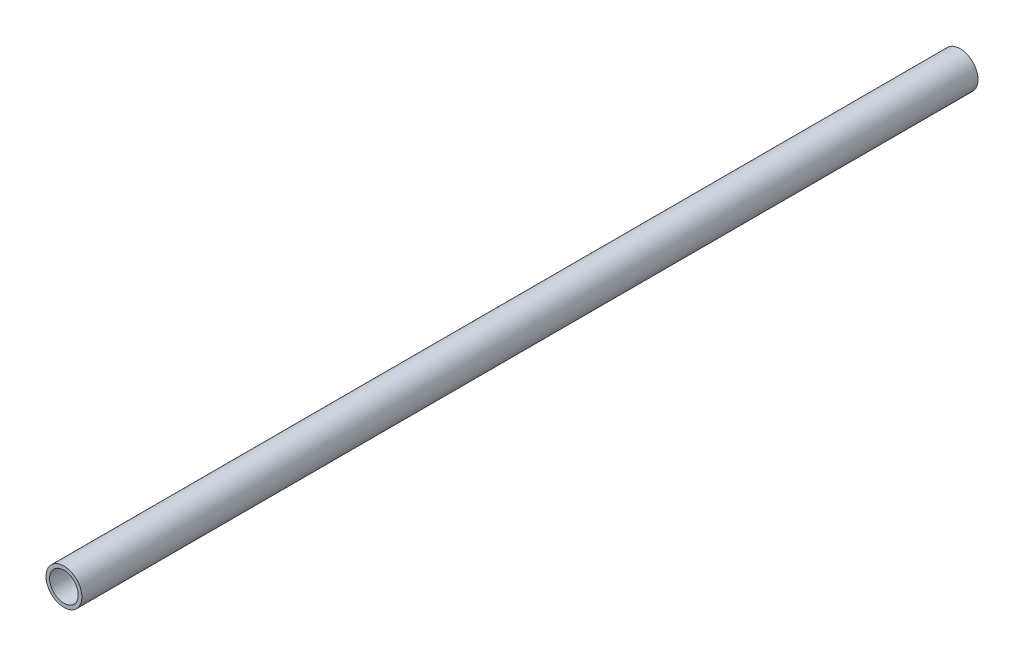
from build123d import *

# Parameters (mm, degrees)
SKETCH1_R      = 12.7
SKETCH1_R_2    = 10.16
EXTRUDE1_DEPTH = 635


with BuildPart() as part:
    # Sketch1 → Extrude1 (new body)
    with BuildSketch(Plane.XY):
        with Locations(Location((0, 0, 0), (0, 0, 180))):
            Circle(SKETCH1_R)
        with Locations(Location((0, 0, 0), (0, 0, 180))):
            Circle(SKETCH1_R_2, mode=Mode.SUBTRACT)
    extrude(amount=EXTRUDE1_DEPTH)


solid = part.part
